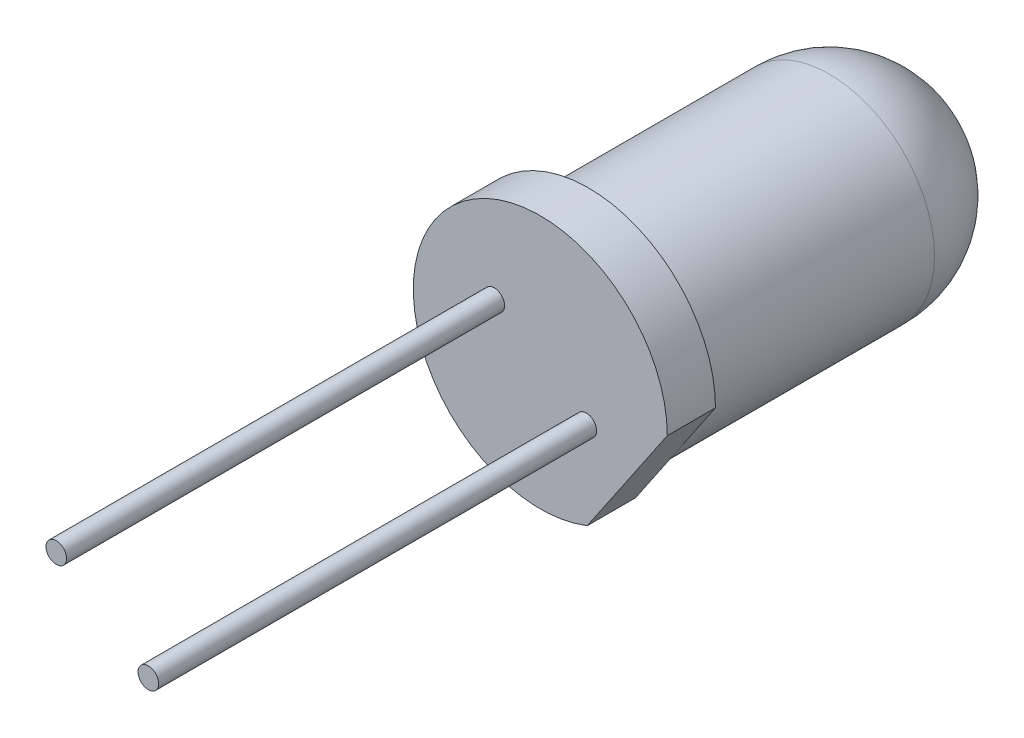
ISO-10303-21;
HEADER;
FILE_DESCRIPTION(('STEP AP214'),'2;1');
FILE_NAME('part.step','',(''),(''),'','','');
FILE_SCHEMA(('AUTOMOTIVE_DESIGN { 1 0 10303 214 1 1 1 1 }'));
ENDSEC;
DATA;
#1=APPLICATION_CONTEXT('core data for automotive mechanical design processes');
#2=APPLICATION_PROTOCOL_DEFINITION('international standard','automotive_design',2000,#1);
#3=PRODUCT_CONTEXT('',#1,'mechanical');
#4=PRODUCT('Part','Part','',(#3));
#5=PRODUCT_RELATED_PRODUCT_CATEGORY('part','',(#4));
#6=PRODUCT_DEFINITION_FORMATION('','',#4);
#7=PRODUCT_DEFINITION_CONTEXT('part definition',#1,'design');
#8=PRODUCT_DEFINITION('design','',#6,#7);
#9=PRODUCT_DEFINITION_SHAPE('','',#8);
#10=(LENGTH_UNIT() NAMED_UNIT(*) SI_UNIT(.MILLI.,.METRE.));
#11=(NAMED_UNIT(*) PLANE_ANGLE_UNIT() SI_UNIT($,.RADIAN.));
#12=(NAMED_UNIT(*) SI_UNIT($,.STERADIAN.) SOLID_ANGLE_UNIT());
#13=UNCERTAINTY_MEASURE_WITH_UNIT(LENGTH_MEASURE(1.E-05),#10,'distance_accuracy_value','');
#14=(GEOMETRIC_REPRESENTATION_CONTEXT(3) GLOBAL_UNCERTAINTY_ASSIGNED_CONTEXT((#13)) GLOBAL_UNIT_ASSIGNED_CONTEXT((#10,
#11,#12)) REPRESENTATION_CONTEXT('',''));
#15=CARTESIAN_POINT('',(0.,0.,0.));
#16=DIRECTION('',(0.,0.,1.));
#17=DIRECTION('',(1.,0.,0.));
#18=AXIS2_PLACEMENT_3D('',#15,#16,#17);
#19=CARTESIAN_POINT('',(10.,10.,1.1));
#20=DIRECTION('',(0.,0.,1.));
#21=DIRECTION('',(1.,0.,0.));
#22=AXIS2_PLACEMENT_3D('',#19,#20,#21);
#23=PLANE('',#22);
#24=DIRECTION('',(-0.561338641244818,-0.827586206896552,0.));
#25=VECTOR('',#24,1.);
#26=CARTESIAN_POINT('',(11.9862068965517,8.65278726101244,1.1));
#27=LINE('',#26,#25);
#28=CARTESIAN_POINT('',(12.9,10.,1.1));
#29=VERTEX_POINT('',#28);
#30=CARTESIAN_POINT('',(11.0724137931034,7.30557452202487,1.1));
#31=VERTEX_POINT('',#30);
#32=EDGE_CURVE('E30',#29,#31,#27,.T.);
#33=ORIENTED_EDGE('',*,*,#32,.F.);
#34=CARTESIAN_POINT('',(10.,10.,1.1));
#35=DIRECTION('',(0.,0.,1.));
#36=DIRECTION('',(1.,0.,0.));
#37=AXIS2_PLACEMENT_3D('',#34,#35,#36);
#38=CIRCLE('',#37,2.9);
#39=EDGE_CURVE('E59',#29,#31,#38,.T.);
#40=ORIENTED_EDGE('',*,*,#39,.T.);
#41=EDGE_LOOP('',(#33,#40));
#42=FACE_BOUND('',#41,.T.);
#43=CARTESIAN_POINT('',(8.94896551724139,10.7129000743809,1.1));
#44=DIRECTION('',(0.,0.,1.));
#45=DIRECTION('',(1.,0.,0.));
#46=AXIS2_PLACEMENT_3D('',#43,#44,#45);
#47=CIRCLE('',#46,0.235341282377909);
#48=CARTESIAN_POINT('',(9.18430679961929,10.7129000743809,1.1));
#49=VERTEX_POINT('',#48);
#50=EDGE_CURVE('E11',#49,#49,#47,.T.);
#51=ORIENTED_EDGE('',*,*,#50,.F.);
#52=EDGE_LOOP('',(#51));
#53=FACE_BOUND('',#52,.T.);
#54=CARTESIAN_POINT('',(11.0510344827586,9.28709992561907,1.1));
#55=DIRECTION('',(0.,0.,1.));
#56=DIRECTION('',(1.,0.,0.));
#57=AXIS2_PLACEMENT_3D('',#54,#55,#56);
#58=CIRCLE('',#57,0.235341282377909);
#59=CARTESIAN_POINT('',(11.2863757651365,9.28709992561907,1.1));
#60=VERTEX_POINT('',#59);
#61=EDGE_CURVE('E89',#60,#60,#58,.T.);
#62=ORIENTED_EDGE('',*,*,#61,.F.);
#63=EDGE_LOOP('',(#62));
#64=FACE_BOUND('',#63,.T.);
#65=ADVANCED_FACE('F26',(#42,#53,#64),#23,.T.);
#66=CARTESIAN_POINT('',(10.,10.,0.));
#67=DIRECTION('',(0.,0.,1.));
#68=DIRECTION('',(1.,0.,0.));
#69=AXIS2_PLACEMENT_3D('',#66,#67,#68);
#70=PLANE('',#69);
#71=CARTESIAN_POINT('',(10.,10.,0.));
#72=DIRECTION('',(0.,0.,1.));
#73=DIRECTION('',(1.,0.,0.));
#74=AXIS2_PLACEMENT_3D('',#71,#72,#73);
#75=CIRCLE('',#74,2.9);
#76=CARTESIAN_POINT('',(12.9,10.,0.));
#77=VERTEX_POINT('',#76);
#78=CARTESIAN_POINT('',(11.0724137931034,7.30557452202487,0.));
#79=VERTEX_POINT('',#78);
#80=EDGE_CURVE('E66',#77,#79,#75,.T.);
#81=ORIENTED_EDGE('',*,*,#80,.F.);
#82=DIRECTION('',(-0.561338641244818,-0.827586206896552,0.));
#83=VECTOR('',#82,1.);
#84=CARTESIAN_POINT('',(12.9,10.,0.));
#85=LINE('',#84,#83);
#86=CARTESIAN_POINT('',(11.9862068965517,8.65278726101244,0.));
#87=VERTEX_POINT('',#86);
#88=EDGE_CURVE('E42',#77,#87,#85,.T.);
#89=ORIENTED_EDGE('',*,*,#88,.T.);
#90=CARTESIAN_POINT('',(10.,10.,0.));
#91=DIRECTION('',(0.,0.,-1.));
#92=DIRECTION('',(-1.,0.,0.));
#93=AXIS2_PLACEMENT_3D('',#90,#91,#92);
#94=CIRCLE('',#93,2.4);
#95=EDGE_CURVE('E65',#87,#87,#94,.T.);
#96=ORIENTED_EDGE('',*,*,#95,.F.);
#97=EDGE_CURVE('E47',#87,#79,#85,.T.);
#98=ORIENTED_EDGE('',*,*,#97,.T.);
#99=EDGE_LOOP('',(#81,#89,#96,#98));
#100=FACE_BOUND('',#99,.T.);
#101=ADVANCED_FACE('F96',(#100),#70,.F.);
#102=CARTESIAN_POINT('',(10.,10.,1.1));
#103=DIRECTION('',(0.,0.,-1.));
#104=DIRECTION('',(-1.,0.,0.));
#105=AXIS2_PLACEMENT_3D('',#102,#103,#104);
#106=CYLINDRICAL_SURFACE('',#105,2.9);
#107=ORIENTED_EDGE('',*,*,#39,.F.);
#108=DIRECTION('',(0.,0.,1.));
#109=VECTOR('',#108,1.);
#110=CARTESIAN_POINT('',(12.9,10.,0.));
#111=LINE('',#110,#109);
#112=EDGE_CURVE('E73',#77,#29,#111,.T.);
#113=ORIENTED_EDGE('',*,*,#112,.F.);
#114=ORIENTED_EDGE('',*,*,#80,.T.);
#115=DIRECTION('',(0.,0.,1.));
#116=VECTOR('',#115,1.);
#117=CARTESIAN_POINT('',(11.0724137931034,7.30557452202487,0.));
#118=LINE('',#117,#116);
#119=EDGE_CURVE('E69',#79,#31,#118,.T.);
#120=ORIENTED_EDGE('',*,*,#119,.T.);
#121=EDGE_LOOP('',(#107,#113,#114,#120));
#122=FACE_BOUND('',#121,.T.);
#123=ADVANCED_FACE('F28',(#122),#106,.T.);
#124=CARTESIAN_POINT('',(10.,10.,-7.9));
#125=DIRECTION('',(0.,0.,1.));
#126=DIRECTION('',(1.,0.,0.));
#127=AXIS2_PLACEMENT_3D('',#124,#125,#126);
#128=CYLINDRICAL_SURFACE('',#127,2.4);
#129=CARTESIAN_POINT('',(10.,10.,-5.5));
#130=DIRECTION('',(0.,0.,1.));
#131=DIRECTION('',(1.,0.,0.));
#132=AXIS2_PLACEMENT_3D('',#129,#130,#131);
#133=CIRCLE('',#132,2.4);
#134=CARTESIAN_POINT('',(12.4,10.,-5.5));
#135=VERTEX_POINT('',#134);
#136=EDGE_CURVE('E74',#135,#135,#133,.T.);
#137=ORIENTED_EDGE('',*,*,#136,.T.);
#138=EDGE_LOOP('',(#137));
#139=FACE_BOUND('',#138,.T.);
#140=ORIENTED_EDGE('',*,*,#95,.T.);
#141=EDGE_LOOP('',(#140));
#142=FACE_BOUND('',#141,.T.);
#143=ADVANCED_FACE('F102',(#139,#142),#128,.T.);
#144=CARTESIAN_POINT('',(10.,10.,-5.5));
#145=DIRECTION('',(0.,0.,1.));
#146=DIRECTION('',(1.,0.,0.));
#147=AXIS2_PLACEMENT_3D('',#144,#145,#146);
#148=SPHERICAL_SURFACE('',#147,2.4);
#149=ORIENTED_EDGE('',*,*,#136,.F.);
#150=EDGE_LOOP('',(#149));
#151=FACE_BOUND('',#150,.T.);
#152=ADVANCED_FACE('F105',(#151),#148,.T.);
#153=CARTESIAN_POINT('',(12.9,10.,0.));
#154=DIRECTION('',(-0.827586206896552,0.561338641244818,0.));
#155=DIRECTION('',(-0.561338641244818,-0.827586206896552,0.));
#156=AXIS2_PLACEMENT_3D('',#153,#154,#155);
#157=PLANE('',#156);
#158=ORIENTED_EDGE('',*,*,#112,.T.);
#159=ORIENTED_EDGE('',*,*,#32,.T.);
#160=ORIENTED_EDGE('',*,*,#119,.F.);
#161=ORIENTED_EDGE('',*,*,#97,.F.);
#162=ORIENTED_EDGE('',*,*,#88,.F.);
#163=EDGE_LOOP('',(#158,#159,#160,#161,#162));
#164=FACE_BOUND('',#163,.T.);
#165=ADVANCED_FACE('F72',(#164),#157,.F.);
#166=CARTESIAN_POINT('',(8.94896551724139,10.7129000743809,11.1));
#167=DIRECTION('',(0.,0.,-1.));
#168=DIRECTION('',(-1.,0.,0.));
#169=AXIS2_PLACEMENT_3D('',#166,#167,#168);
#170=CYLINDRICAL_SURFACE('',#169,0.235341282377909);
#171=CARTESIAN_POINT('',(8.94896551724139,10.7129000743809,11.1));
#172=DIRECTION('',(0.,0.,1.));
#173=DIRECTION('',(1.,0.,0.));
#174=AXIS2_PLACEMENT_3D('',#171,#172,#173);
#175=CIRCLE('',#174,0.235341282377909);
#176=CARTESIAN_POINT('',(9.18430679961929,10.7129000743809,11.1));
#177=VERTEX_POINT('',#176);
#178=EDGE_CURVE('E81',#177,#177,#175,.T.);
#179=ORIENTED_EDGE('',*,*,#178,.F.);
#180=EDGE_LOOP('',(#179));
#181=FACE_BOUND('',#180,.T.);
#182=ORIENTED_EDGE('',*,*,#50,.T.);
#183=EDGE_LOOP('',(#182));
#184=FACE_BOUND('',#183,.T.);
#185=ADVANCED_FACE('F111',(#181,#184),#170,.T.);
#186=CARTESIAN_POINT('',(8.94896551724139,10.7129000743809,11.1));
#187=DIRECTION('',(0.,0.,1.));
#188=DIRECTION('',(1.,0.,0.));
#189=AXIS2_PLACEMENT_3D('',#186,#187,#188);
#190=PLANE('',#189);
#191=ORIENTED_EDGE('',*,*,#178,.T.);
#192=EDGE_LOOP('',(#191));
#193=FACE_BOUND('',#192,.T.);
#194=ADVANCED_FACE('F112',(#193),#190,.T.);
#195=CARTESIAN_POINT('',(11.0510344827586,9.28709992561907,11.1));
#196=DIRECTION('',(0.,0.,-1.));
#197=DIRECTION('',(-1.,0.,0.));
#198=AXIS2_PLACEMENT_3D('',#195,#196,#197);
#199=CYLINDRICAL_SURFACE('',#198,0.235341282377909);
#200=CARTESIAN_POINT('',(11.0510344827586,9.28709992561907,11.1));
#201=DIRECTION('',(0.,0.,1.));
#202=DIRECTION('',(1.,0.,0.));
#203=AXIS2_PLACEMENT_3D('',#200,#201,#202);
#204=CIRCLE('',#203,0.235341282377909);
#205=CARTESIAN_POINT('',(11.2863757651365,9.28709992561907,11.1));
#206=VERTEX_POINT('',#205);
#207=EDGE_CURVE('E85',#206,#206,#204,.T.);
#208=ORIENTED_EDGE('',*,*,#207,.F.);
#209=EDGE_LOOP('',(#208));
#210=FACE_BOUND('',#209,.T.);
#211=ORIENTED_EDGE('',*,*,#61,.T.);
#212=EDGE_LOOP('',(#211));
#213=FACE_BOUND('',#212,.T.);
#214=ADVANCED_FACE('F93',(#210,#213),#199,.T.);
#215=CARTESIAN_POINT('',(11.0510344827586,9.28709992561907,11.1));
#216=DIRECTION('',(0.,0.,1.));
#217=DIRECTION('',(1.,0.,0.));
#218=AXIS2_PLACEMENT_3D('',#215,#216,#217);
#219=PLANE('',#218);
#220=ORIENTED_EDGE('',*,*,#207,.T.);
#221=EDGE_LOOP('',(#220));
#222=FACE_BOUND('',#221,.T.);
#223=ADVANCED_FACE('F116',(#222),#219,.T.);
#224=CLOSED_SHELL('',(#65,#101,#123,#143,#152,#165,#185,#194,#214,#223));
#225=MANIFOLD_SOLID_BREP('B2',#224);
#226=ADVANCED_BREP_SHAPE_REPRESENTATION('',(#18,#225),#14);
#227=SHAPE_DEFINITION_REPRESENTATION(#9,#226);
ENDSEC;
END-ISO-10303-21;
